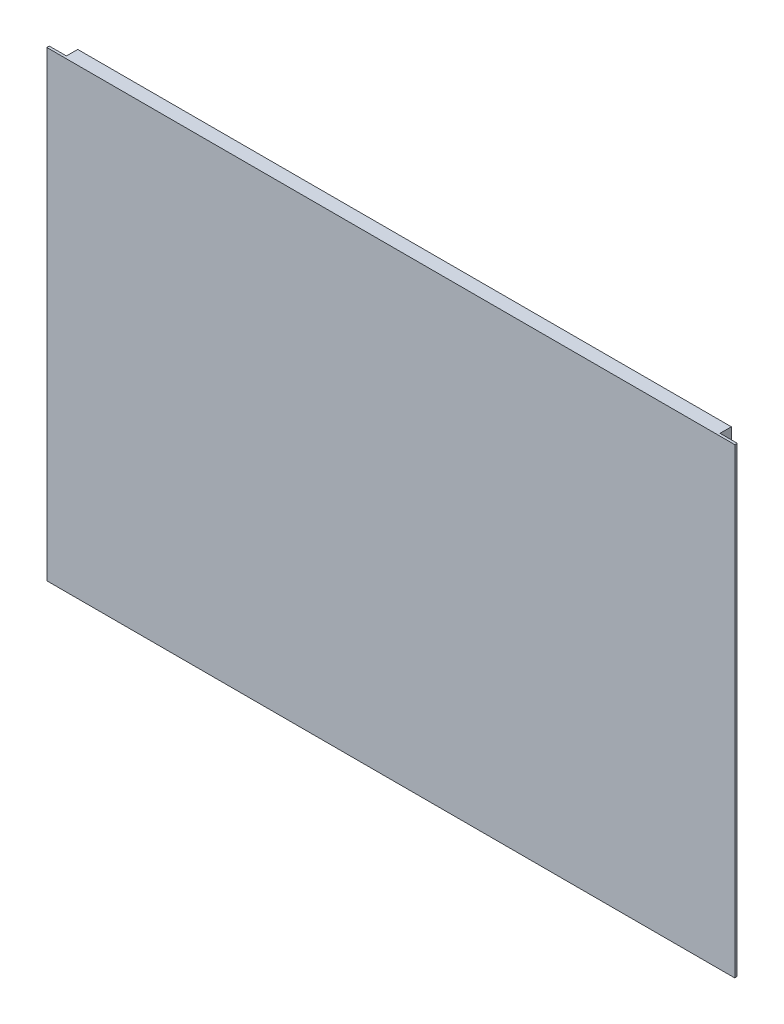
from build123d import *

# Parameters (mm, degrees)
IZIM5_W                     = 140
IZIM5_H                     = 94
Y_KSEKLIK_EKSTR_ZYON5_DEPTH = 1
Y_KSEKLIK_EKSTR_ZYON6_DEPTH = 140
L_O_ALTMA1_COUNT            = 16
L_O_ALTMA1_PITCH            = 6
IZIM11_W                    = 3.3
IZIM11_H                    = 0.9
Y_KSEKLIK_EKSTR_ZYON7_DEPTH = 140
KES_EKSTR_ZYON4_DEPTH       = 140
Y_KSEKLIK_EKSTR_ZYON8_DEPTH = 140
KES_EKSTR_ZYON7_DEPTH       = 3
KES_EKSTR_ZYON9_REACH       = 97.154
KES_EKSTR_ZYON15_DEPTH      = 2.3
IZIM26_W                    = 8
IZIM26_H                    = 51.5
KES_EKSTR_ZYON16_DEPTH      = 2.3
KES_EKSTR_ZYON17_DEPTH      = 2.3
KES_EKSTR_ZYON18_DEPTH      = 2.3
IZIM32_W                    = 140
IZIM32_H                    = 94
KES_EKSTR_ZYON19_DEPTH      = 0.5


with BuildPart() as part:
    # izim5 → Y_kseklik-Ekstr_zyon5 (new body)
    with BuildSketch(Plane.XY):
        with Locations((-8.695652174, -6.130434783)):
            Rectangle(IZIM5_W, IZIM5_H)
    extrude(amount=-Y_KSEKLIK_EKSTR_ZYON5_DEPTH)

    # izim7 → Y_kseklik-Ekstr_zyon6 (add)
    with BuildSketch(Plane.ZY.offset(78.695652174)):
        Polygon((-1, -53.030434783), (-3.3, -52.530434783), (-3.3, -50.030434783), (-1, -49.530434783), align=None)
    y_kseklik_ekstr_zyon6 = extrude(amount=-Y_KSEKLIK_EKSTR_ZYON6_DEPTH)

    # L_o_altma1: Y_kseklik-Ekstr_zyon6 ×16
    with Locations(*[(0, i * L_O_ALTMA1_PITCH, 0) for i in range(1, L_O_ALTMA1_COUNT)]):
        add(y_kseklik_ekstr_zyon6)

    # izim11 → Y_kseklik-Ekstr_zyon7 (add)
    with BuildSketch(Plane.ZY.offset(78.695652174)):
        with Locations((-1.65, 40.419565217)):
            Rectangle(IZIM11_W, IZIM11_H)
    extrude(amount=-Y_KSEKLIK_EKSTR_ZYON7_DEPTH)

    # izim13 → Kes-Ekstr_zyon4 (cut)
    with BuildSketch(Plane.ZY.offset(78.695652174)):
        Polygon((-1, -53.030434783), (1.243008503, -53.409349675), (-0.849031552, -53.522871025), align=None)
    extrude(amount=-KES_EKSTR_ZYON4_DEPTH, mode=Mode.SUBTRACT)


with BuildPart() as kes_ekstr_zyon4_piece_1:
    # of the separate pieces the step leaves, piece 1, a body of its own (kes_ekstr_zyon4_pieces)
    add(part.part.solids().sort_by_distance((-78.695652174, 40.869565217, -3.3))[0])

    # izim14 → Y_kseklik-Ekstr_zyon8 (add)
    with BuildSketch(Plane.ZY.offset(78.695652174)):
        with BuildLine():
            Line((-3.3, 33.969565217), (-7.446751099, 33.969565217))
            add(Edge.make_bspline(
                [(-9.5, 33.469565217), (-8.522252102, 33.926568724), (-7.446751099, 33.969565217)],
                knots=[0, 0, 0, 1, 1, 1], degree=2))
            Line((-9.5, 33.469565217), (-9.5, 32.469565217))
            add(Edge.make_bspline(
                [(-3.3, 31.469565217), (-6.475336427, 31.475292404), (-9.5, 32.469565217)],
                knots=[0, 0, 0, 1, 1, 1], degree=2))
            Line((-3.3, 31.469565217), (-3.3, 33.969565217))
        make_face()
    extrude(amount=-Y_KSEKLIK_EKSTR_ZYON8_DEPTH)

    # izim15 → Kes-Ekstr_zyon7 (cut)
    with BuildSketch(Plane(origin=(0, 33.969565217, 0), x_dir=(1, 0, 0), z_dir=(0, 1, 0))):
        with BuildLine():
            Line((-78.695652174, 3.3), (-74.695652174, 3.3))
            add(Edge.make_bspline(
                [(-74.695652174, 3.3), (-69.575344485, 8.005227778), (-62.695652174, 9.5)],
                knots=[0, 0, 0, 1, 1, 1], degree=2))
            Line((-62.695652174, 9.5), (-78.695652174, 9.5))
            Line((-78.695652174, 9.5), (-78.695652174, 3.3))
        make_face()
        with BuildLine():
            Line((61.304347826, 2.8), (57.304347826, 2.8))
            add(Edge.make_bspline(
                [(57.304347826, 2.8), (52.499558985, 8.164618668), (45.304347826, 9.5)],
                knots=[0, 0, 0, 1, 1, 1], degree=2))
            Line((45.304347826, 9.5), (61.304347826, 9.5))
            Line((61.304347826, 9.5), (61.304347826, 2.8))
        make_face()
    extrude(amount=-KES_EKSTR_ZYON7_DEPTH, mode=Mode.SUBTRACT)

    # Kes-Ekstr_zyon9: up to this face of the body (flat: up to its plane)
    kes_ekstr_zyon9_end = Plane(kes_ekstr_zyon4_piece_1.part.faces().sort_by_distance((-8.695652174, -6.280434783, -1))[0])
    # izim17 → Kes-Ekstr_zyon9 (cut, up to the picked face)
    with BuildSketch(Plane(origin=(0, 0, -3.3), x_dir=(-1, 0, 0), z_dir=(0, 0, -1)), mode=Mode.PRIVATE) as kes_ekstr_zyon9_sk1:
        Polygon((-61.304347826, 40.869565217), (-61.304347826, -53.130434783), (-57.804347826, -53.130434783), (-57.804347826, 44.537071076), (-61.304347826, 44.537071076), align=None)
    kes_ekstr_zyon9_tool1 = split(extrude(kes_ekstr_zyon9_sk1.sketch, amount=-KES_EKSTR_ZYON9_REACH, mode=Mode.PRIVATE), bisect_by=kes_ekstr_zyon9_end, keep=Keep.BOTH, mode=Mode.PRIVATE)
    # izim17 → Kes-Ekstr_zyon9 (cut, up to the picked face)
    with BuildSketch(Plane(origin=(0, 0, -3.3), x_dir=(-1, 0, 0), z_dir=(0, 0, -1)), mode=Mode.PRIVATE) as kes_ekstr_zyon9_sk2:
        Polygon((78.695652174, 44.537071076), (78.695652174, 40.869565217), (78.695652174, -53.130434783), (75.195652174, -53.130434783), (75.195652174, 44.537071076), align=None)
    kes_ekstr_zyon9_tool2 = split(extrude(kes_ekstr_zyon9_sk2.sketch, amount=-KES_EKSTR_ZYON9_REACH, mode=Mode.PRIVATE), bisect_by=kes_ekstr_zyon9_end, keep=Keep.BOTH, mode=Mode.PRIVATE)
    add(kes_ekstr_zyon9_tool1.solids().sort_by(Axis((59.554348, -4.296682, -3.3), (0, 0, 1)))[0], mode=Mode.SUBTRACT)
    add(kes_ekstr_zyon9_tool2.solids().sort_by(Axis((-76.945652, -4.296682, -3.3), (0, 0, 1)))[0], mode=Mode.SUBTRACT)

    # izim23 → Kes-Ekstr_zyon15 (cut)
    with BuildSketch(Plane(origin=(0, 0, -3.3), x_dir=(-1, 0, 0), z_dir=(0, 0, -1))):
        Polygon((-51.304347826, -35.030434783), (-31.304347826, 16.469565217), (-25.304347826, 16.469565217), (-45.304347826, -35.030434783), align=None)
        Polygon((-15.304347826, 16.469565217), (-9.304347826, 16.469565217), (-29.304347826, -35.030434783), (-35.304347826, -35.030434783), align=None)
        Polygon((0.695652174, 16.469565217), (6.695652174, 16.469565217), (-13.304347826, -35.030434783), (-19.304347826, -35.030434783), align=None)
        Polygon((22.695652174, 16.469565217), (2.695652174, -35.030434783), (-3.304347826, -35.030434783), (16.695652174, 16.469565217), align=None)
    extrude(amount=-KES_EKSTR_ZYON15_DEPTH, mode=Mode.SUBTRACT)

    # izim26 → Kes-Ekstr_zyon16 (cut)
    with BuildSketch(Plane(origin=(0, 0, -3.3), x_dir=(-1, 0, 0), z_dir=(0, 0, -1))):
        with Locations((62.695652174, -9.280434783)):
            Rectangle(IZIM26_W, IZIM26_H)
    extrude(amount=-KES_EKSTR_ZYON16_DEPTH, mode=Mode.SUBTRACT)

    # izim28 → Kes-Ekstr_zyon17 (cut)
    with BuildSketch(Plane(origin=(0, 0, -3.3), x_dir=(-1, 0, 0), z_dir=(0, 0, -1))):
        Polygon((12.695652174, -35.030434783), (22.695652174, -35.030434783), (21.423386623, -17.030434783), (19.608132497, -17.022807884), align=None)
        Polygon((38.695652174, -35.030434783), (48.695652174, -35.030434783), (49.059750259, -17.030434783), (47.241568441, -17.030434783), align=None)
    extrude(amount=-KES_EKSTR_ZYON17_DEPTH, mode=Mode.SUBTRACT)

    # izim31 → Kes-Ekstr_zyon18 (cut)
    with BuildSketch(Plane(origin=(0, 0, -3.3), x_dir=(-1, 0, 0), z_dir=(0, 0, -1))):
        Polygon((36.592886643, -1.530434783), (40.341461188, -1.530434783), (50.695652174, 16.469565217), (32.695652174, 16.469565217), align=None)
    extrude(amount=-KES_EKSTR_ZYON18_DEPTH, mode=Mode.SUBTRACT)

    # izim32 → Kes-Ekstr_zyon19 (cut)
    with BuildSketch(Plane.XY):
        with Locations((-8.695652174, -6.130434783)):
            Rectangle(IZIM32_W, IZIM32_H)
    extrude(amount=-KES_EKSTR_ZYON19_DEPTH, mode=Mode.SUBTRACT)


with BuildPart() as kes_ekstr_zyon4_piece_2:
    # of the separate pieces the step leaves, piece 2, a body of its own (kes_ekstr_zyon4_pieces)
    add(part.part.solids().sort_by_distance((-78.695652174, -53.130434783, -1))[0])


solid = Compound([kes_ekstr_zyon4_piece_1.part, kes_ekstr_zyon4_piece_2.part])
